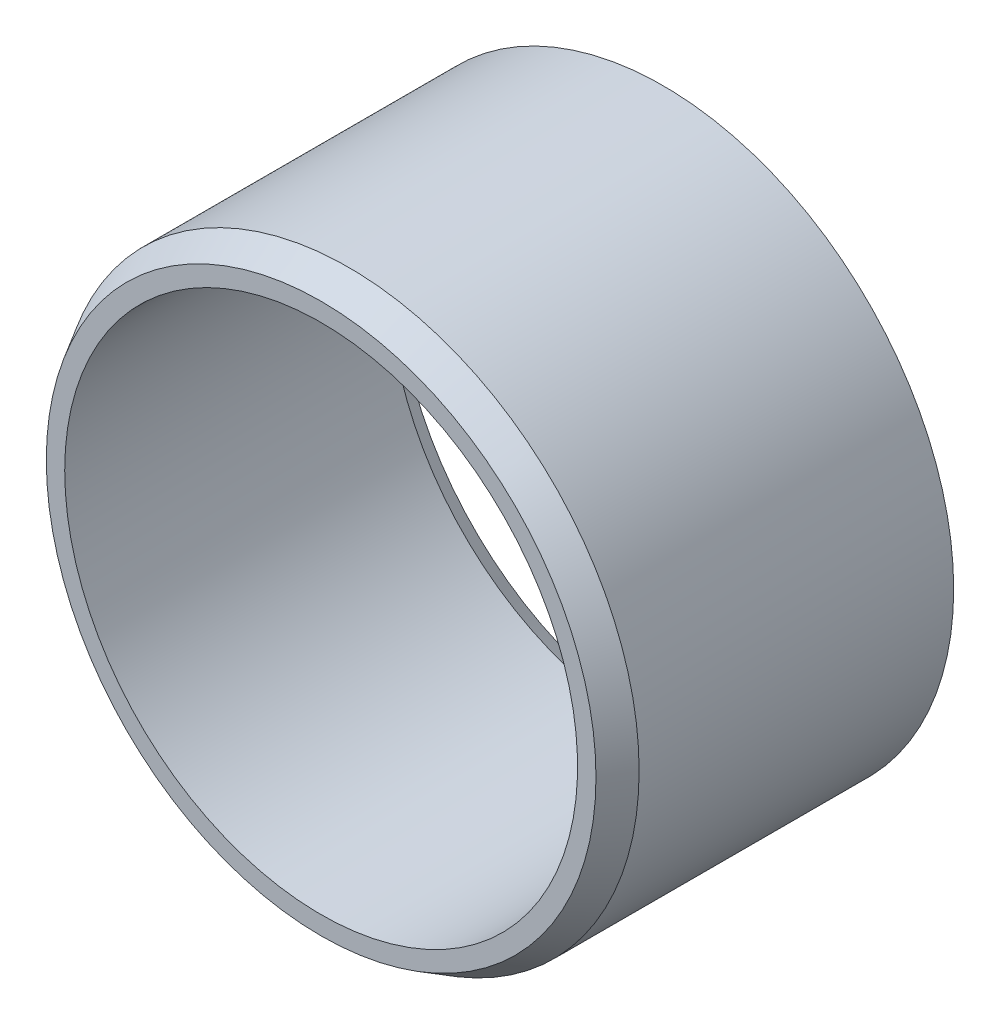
from build123d import *

# Parameters (mm, degrees)
ESQUISSE1_W      = 10
ESQUISSE1_H      = 1
CHANFREIN1_SIZE  = 0.5
CHANFREIN1_SIZE2 = 0.288675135
CHANFREIN2_SIZE  = 0.8
CHANFREIN2_SIZE2 = 0.461880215


with BuildPart() as part:
    # Esquisse1 → R_volution1 (revolve)
    with BuildSketch(Plane(origin=(0, 0, 0), x_dir=(0, 0, -1), z_dir=(1, 0, 0)), mode=Mode.PRIVATE) as r_volution1_sk:
        with Locations((-26.822033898, 8)):
            Rectangle(ESQUISSE1_W, ESQUISSE1_H)
    revolve(r_volution1_sk.sketch.rotate(Axis((0, 0, 0), (0, 0, 1)), 90), axis=Axis((0, 0, 0), (0, 0, 1)))

    # Chanfrein1
    chanfrein1_edges = [part.edges().sort_by_distance(p)[0] for p in [
        (7.5, 0, 21.822033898),
    ]]
    chanfrein1_side = [part.faces().sort_by_distance(p)[0] for p in [
        (7.5, 0, 26.822033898),
    ]]
    chamfer(chanfrein1_edges, length=CHANFREIN1_SIZE, length2=CHANFREIN1_SIZE2, reference=chanfrein1_side[0])

    # Chanfrein2
    chanfrein2_edges = [part.edges().sort_by_distance(p)[0] for p in [
        (8.5, 0, 31.822033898),
    ]]
    chanfrein2_side = [part.faces().sort_by_distance(p)[0] for p in [
        (8.5, 0, 26.822033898),
    ]]
    chamfer(chanfrein2_edges, length=CHANFREIN2_SIZE, length2=CHANFREIN2_SIZE2, reference=chanfrein2_side[0])


solid = part.part
